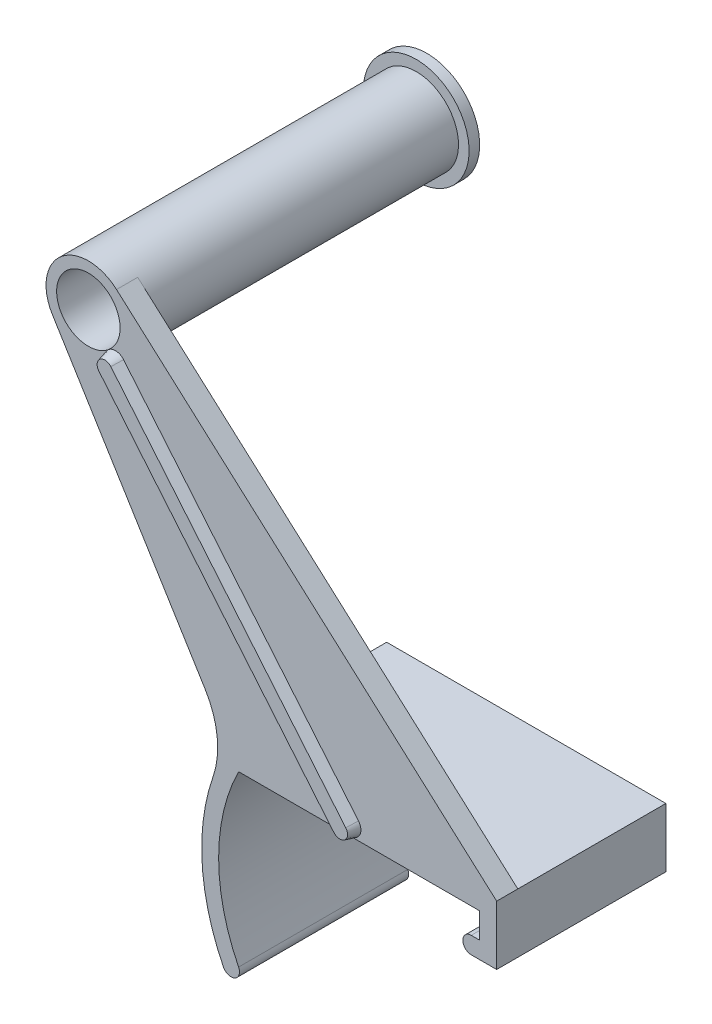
from build123d import *

# Parameters (mm, degrees)
SKETCH1_R           = 9.525
BOSS_EXTRUDE1_DEPTH = 6.35
BOSS_EXTRUDE2_DEPTH = 50.8
SKETCH1_4_R         = 12.7
SKETCH1_4_R_2       = 9.525
BOSS_EXTRUDE3_DEPTH = 101.6
BOSS_EXTRUDE4_START = -3.175
SKETCH2_R           = 15.875
SKETCH2_R_2         = 9.525
BOSS_EXTRUDE4_DEPTH = 3.175
BOSS_EXTRUDE5_DEPTH = 3.175
BOSS_EXTRUDE5_TAPER = 15


with BuildPart() as part:
    # Sketch1 → Boss-Extrude1 (new body)
    with BuildSketch(Plane.XY):
        with BuildLine():
            Line((0, 0), (-2.54, 0))
            ThreePointArc((-2.54, 0), (-5.08, -2.54), (-2.54, -5.08))
            Line((-2.54, -5.08), (5.08, -5.08))
            Line((5.08, -5.08), (5.08, 12.7))
            Line((5.08, 12.7), (-109.034171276, 114.656866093))
            ThreePointArc((-109.034171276, 114.656866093), (-125.646811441, 114.925433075), (-128.308731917, 98.525246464))
            Line((-128.308731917, 98.525246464), (-82.444752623, 24.073856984))
            ThreePointArc((-82.444752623, 24.073856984), (-78.822923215, 13.528536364), (-80.066301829, 2.448128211))
            ThreePointArc((-80.066301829, 2.448128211), (-83.33422647, -21.818012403), (-76.93369013, -45.451845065))
            ThreePointArc((-76.93369013, -45.451845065), (-73.525922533, -46.587767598), (-72.39, -43.18))
            ThreePointArc((-72.39, -43.18), (-78.386126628, -17.78), (-72.39, 7.62))
            Line((-72.39, 7.62), (0, 7.62))
            Line((0, 7.62), (0, 0))
        make_face()
        with Locations((-117.495767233, 105.186312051)):
            Circle(SKETCH1_R, mode=Mode.SUBTRACT)
    extrude(amount=-BOSS_EXTRUDE1_DEPTH)

    # Sketch1_3 → Boss-Extrude2 (add)
    with BuildSketch(Plane.XY):
        with BuildLine():
            Line((0, 0), (-2.54, 0))
            ThreePointArc((-2.54, 0), (-5.08, -2.54), (-2.54, -5.08))
            Line((-2.54, -5.08), (5.08, -5.08))
            Line((5.08, -5.08), (5.08, 12.7))
            Line((5.08, 12.7), (-78.745512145, 12.7))
            ThreePointArc((-78.745512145, 12.7), (-78.878890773, 7.506166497), (-80.066301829, 2.448128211))
            ThreePointArc((-80.066301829, 2.448128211), (-83.33422647, -21.818012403), (-76.93369013, -45.451845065))
            ThreePointArc((-76.93369013, -45.451845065), (-73.525922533, -46.587767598), (-72.39, -43.18))
            ThreePointArc((-72.39, -43.18), (-78.386126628, -17.78), (-72.39, 7.62))
            Line((-72.39, 7.62), (0, 7.62))
            Line((0, 7.62), (0, 0))
        make_face()
    extrude(amount=-BOSS_EXTRUDE2_DEPTH)

    # Sketch1_4 → Boss-Extrude3 (add)
    with BuildSketch(Plane.XY):
        with Locations((-117.495767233, 105.186312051)):
            Circle(SKETCH1_4_R)
        with Locations((-117.495767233, 105.186312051)):
            Circle(SKETCH1_4_R_2, mode=Mode.SUBTRACT)
    extrude(amount=-BOSS_EXTRUDE3_DEPTH)

    # Sketch2 → Boss-Extrude4 (add)
    with BuildSketch(Plane(origin=(0, 0, -101.6), x_dir=(-1, 0, 0), z_dir=(0, 0, -1)).offset(BOSS_EXTRUDE4_START)):
        with Locations((117.495767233, 105.186312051)):
            Circle(SKETCH2_R)
        with Locations(Location((117.495767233, 105.186312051, 0), (0, 0, 180))):
            Circle(SKETCH2_R_2, mode=Mode.SUBTRACT)
    extrude(amount=BOSS_EXTRUDE4_DEPTH)

    # Sketch3 → Boss-Extrude5 (add)
    with BuildSketch(Plane.XY):
        with BuildLine():
            Line((-111.804848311, 93.397161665), (-41.27984493, 8.762480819))
            ThreePointArc((-41.27984493, 8.762480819), (-36.808167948, 8.355842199), (-36.401529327, 12.827519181))
            Line((-36.401529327, 12.827519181), (-106.926532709, 97.462200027))
            ThreePointArc((-106.926532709, 97.462200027), (-111.398209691, 97.868838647), (-111.804848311, 93.397161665))
        make_face()
    extrude(amount=BOSS_EXTRUDE5_DEPTH, taper=BOSS_EXTRUDE5_TAPER)


solid = part.part
